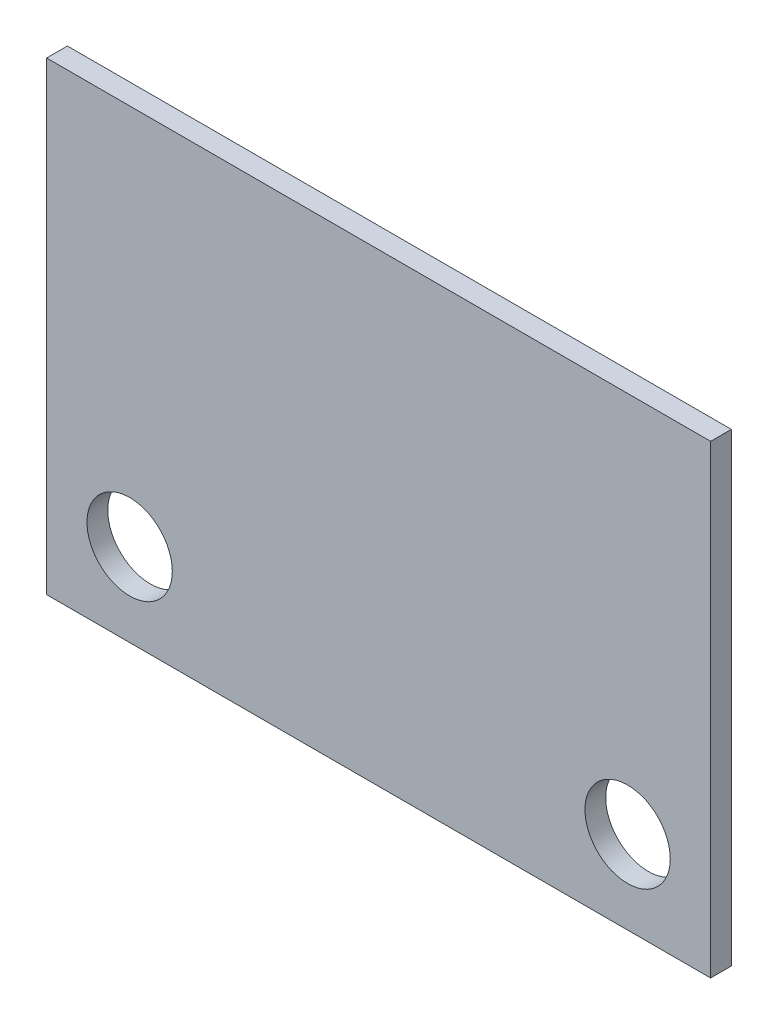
from build123d import *

# Parameters (mm, degrees)
SKETCH1_W                      = 25.4
SKETCH1_H                      = 17.78
EXTRUDE1_DEPTH                 = 0.79375
F_30_0_128500_DIAMETER_HOLE1_D = 3.2639


with BuildPart() as part:
    # Sketch1 → Extrude1 (new body)
    with BuildSketch(Plane.XY):
        with Locations((0, 8.89)):
            Rectangle(SKETCH1_W, SKETCH1_H)
    extrude(amount=EXTRUDE1_DEPTH)

    # 30 _0.128500_ Diameter Hole1 (through all)
    with Locations(Plane(origin=(-9.525, 3.175, 0.79375), x_dir=(1, 0, 0), z_dir=(0, 0, 1))):
        with Locations((0, 0), (19.05, 0)):
            Hole(F_30_0_128500_DIAMETER_HOLE1_D / 2)


solid = part.part
